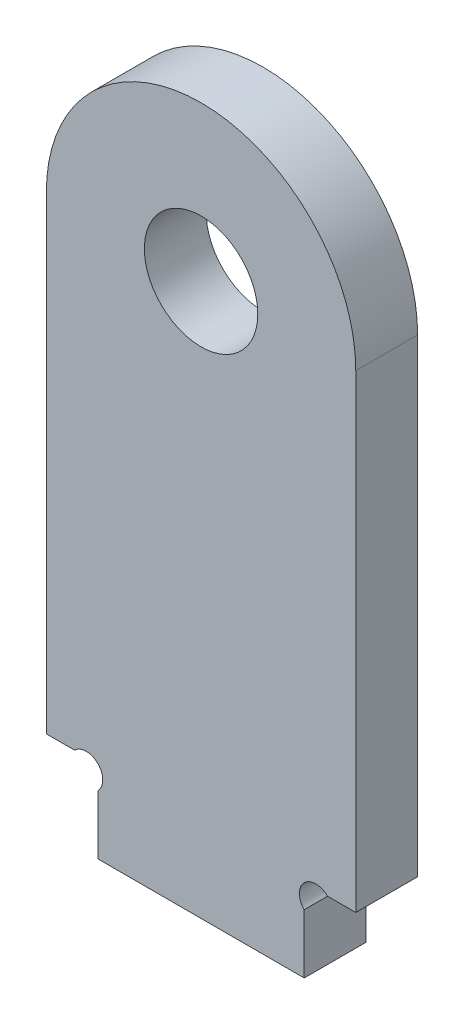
from build123d import *

# Parameters (mm, degrees)
ESQUISSE1_R      = 5.5
EXTRUSION1_DEPTH = 6


with BuildPart() as part:
    # Esquisse1 → Extrusion1 (new body)
    with BuildSketch(Plane.XY):
        with BuildLine():
            Line((0, 45.5), (0, 0))
            Line((0, 0), (2.7372583, 0))
            ThreePointArc((2.7372583, 0), (5, 0), (5, -2.2627417))
            Line((5, -2.2627417), (5, -8))
            Line((5, -8), (25, -8))
            Line((25, -8), (25, -2.2627417))
            ThreePointArc((25, -2.2627417), (25, 0), (27.2627417, 0))
            Line((27.2627417, 0), (30, 0))
            Line((30, 0), (30, 45.5))
            ThreePointArc((30, 45.5), (15, 60.5), (0, 45.5))
        make_face()
        with Locations((15, 45.5)):
            Circle(ESQUISSE1_R, mode=Mode.SUBTRACT)
    extrude(amount=EXTRUSION1_DEPTH)


solid = part.part
